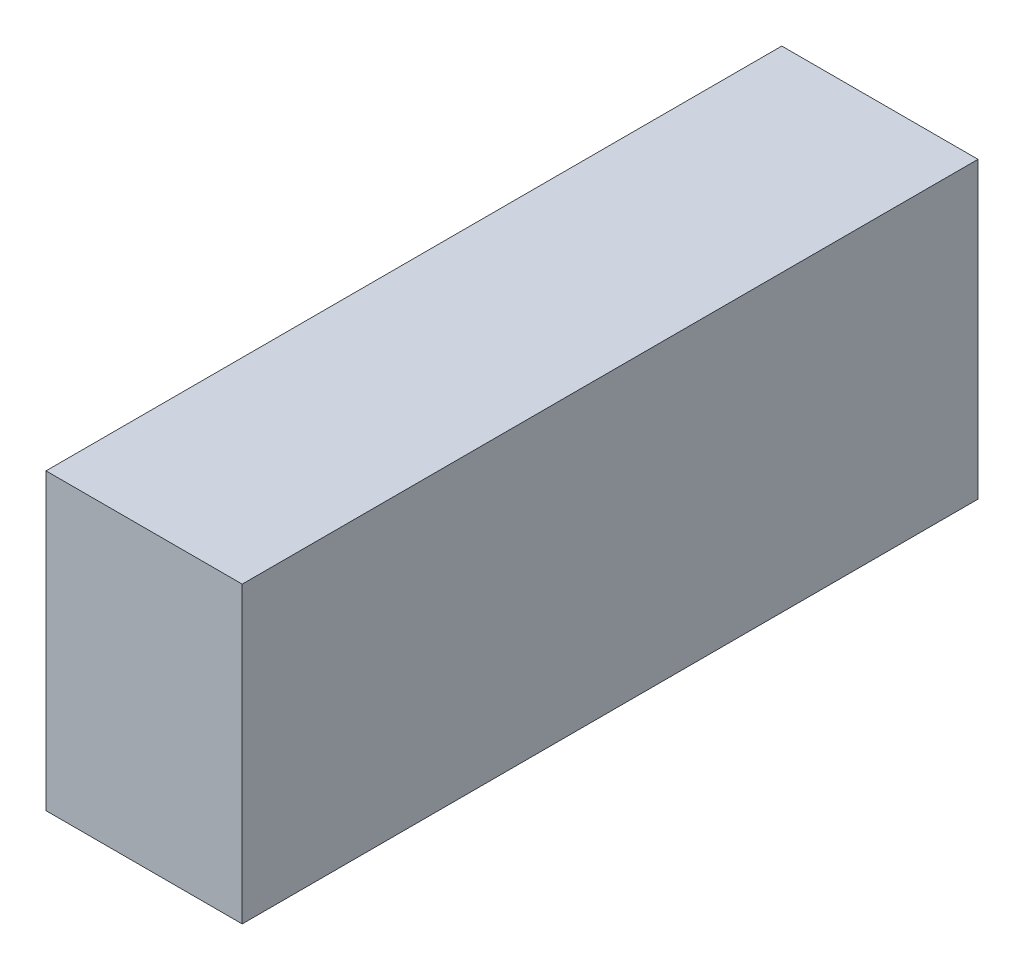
from build123d import *

# Parameters (mm, degrees)
SKETCH1_W           = 4
SKETCH1_H           = 15
BOSS_EXTRUDE1_DEPTH = 6


with BuildPart() as part:
    # Sketch1 → Boss-Extrude1 (new body)
    with BuildSketch(Plane(origin=(0, 0, 0), x_dir=(1, 0, 0), z_dir=(0, 1, 0))):
        with Locations((2, -7.5)):
            Rectangle(SKETCH1_W, SKETCH1_H)
    extrude(amount=BOSS_EXTRUDE1_DEPTH)


solid = part.part
